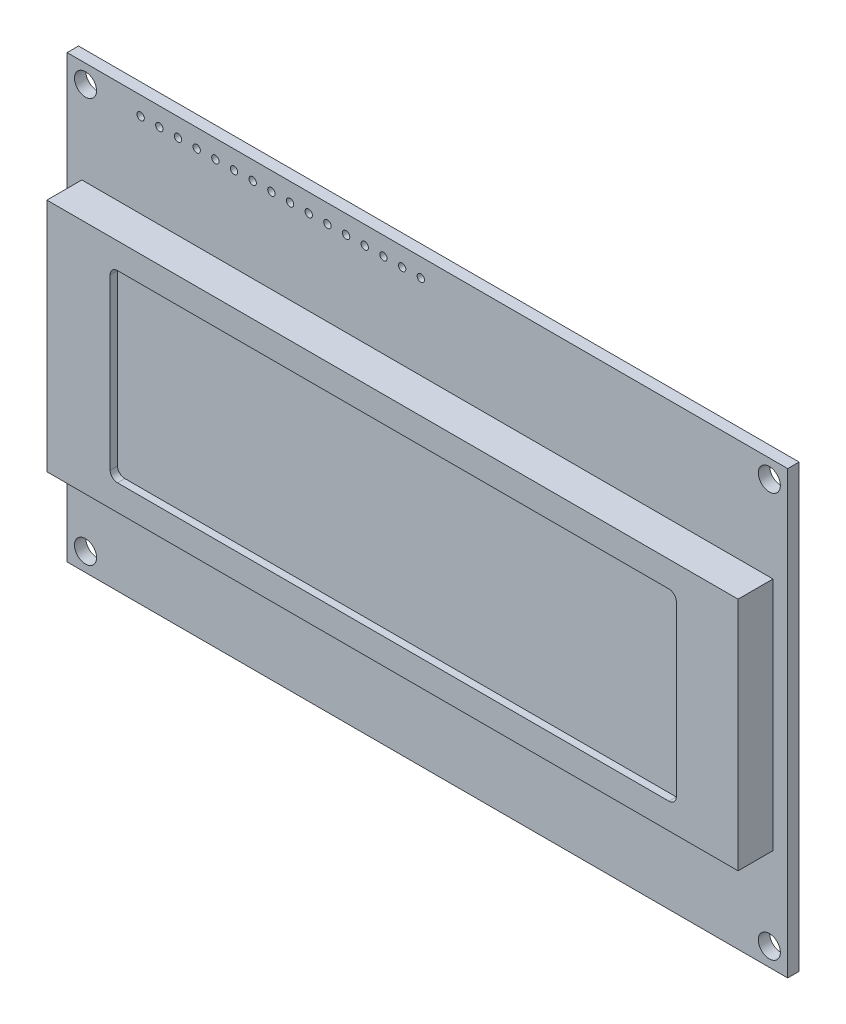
from build123d import *

# Parameters (mm, degrees)
ESQUISSE1_W             = 98
ESQUISSE1_H             = 60
ESQUISSE1_R             = 1.5
ESQUISSE1_R_2           = 0.5
BOSS_EXTRU_1_DEPTH      = 1.55
ESQUISSE2_W             = 94
ESQUISSE2_H             = 32
BOSS_EXTRU_2_DEPTH      = 4.75
ENL_V_MAT_EXTRU_2_DEPTH = 1


with BuildPart() as part:
    # Esquisse1 → Boss.-Extru.1 (new body)
    with BuildSketch(Plane.XY):
        with Locations((-13.900836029, 1.990498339)):
            Rectangle(ESQUISSE1_W, ESQUISSE1_H)
        with Locations(Location((-60.400836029, 29.490498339, 0), (0, 0, 180))):
            Circle(ESQUISSE1_R, mode=Mode.SUBTRACT)
        with Locations(Location((32.599163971, 29.490498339, 0), (0, 0, 180))):
            Circle(ESQUISSE1_R, mode=Mode.SUBTRACT)
        with Locations(Location((32.599163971, -25.509501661, 0), (0, 0, 180))):
            Circle(ESQUISSE1_R, mode=Mode.SUBTRACT)
        with Locations(Location((-60.400836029, -25.509501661, 0), (0, 0, 180))):
            Circle(ESQUISSE1_R, mode=Mode.SUBTRACT)
        with Locations((-52.900836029, 29.490498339)):
            Circle(ESQUISSE1_R_2, mode=Mode.SUBTRACT)
        with Locations((-50.360836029, 29.490498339)):
            Circle(ESQUISSE1_R_2, mode=Mode.SUBTRACT)
        with Locations((-47.820836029, 29.490498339)):
            Circle(ESQUISSE1_R_2, mode=Mode.SUBTRACT)
        with Locations((-45.280836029, 29.490498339)):
            Circle(ESQUISSE1_R_2, mode=Mode.SUBTRACT)
        with Locations((-42.740836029, 29.490498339)):
            Circle(ESQUISSE1_R_2, mode=Mode.SUBTRACT)
        with Locations((-40.200836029, 29.490498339)):
            Circle(ESQUISSE1_R_2, mode=Mode.SUBTRACT)
        with Locations((-37.660836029, 29.490498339)):
            Circle(ESQUISSE1_R_2, mode=Mode.SUBTRACT)
        with Locations((-35.120836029, 29.490498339)):
            Circle(ESQUISSE1_R_2, mode=Mode.SUBTRACT)
        with Locations((-32.580836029, 29.490498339)):
            Circle(ESQUISSE1_R_2, mode=Mode.SUBTRACT)
        with Locations((-30.040836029, 29.490498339)):
            Circle(ESQUISSE1_R_2, mode=Mode.SUBTRACT)
        with Locations((-27.500836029, 29.490498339)):
            Circle(ESQUISSE1_R_2, mode=Mode.SUBTRACT)
        with Locations((-24.960836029, 29.490498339)):
            Circle(ESQUISSE1_R_2, mode=Mode.SUBTRACT)
        with Locations((-22.420836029, 29.490498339)):
            Circle(ESQUISSE1_R_2, mode=Mode.SUBTRACT)
        with Locations((-19.880836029, 29.490498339)):
            Circle(ESQUISSE1_R_2, mode=Mode.SUBTRACT)
        with Locations((-17.340836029, 29.490498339)):
            Circle(ESQUISSE1_R_2, mode=Mode.SUBTRACT)
        with Locations((-14.800836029, 29.490498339)):
            Circle(ESQUISSE1_R_2, mode=Mode.SUBTRACT)
    extrude(amount=BOSS_EXTRU_1_DEPTH)

    # Esquisse2 → Boss.-Extru.2 (add)
    with BuildSketch(Plane.XY.offset(1.55)):
        with Locations((-13.900836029, 1.990498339)):
            Rectangle(ESQUISSE2_W, ESQUISSE2_H)
    extrude(amount=BOSS_EXTRU_2_DEPTH)

    # Esquisse5 → Enl_v. mat.-Extru.2 (cut)
    with BuildSketch(Plane.XY.offset(6.3)):
        with BuildLine():
            Line((-51.300836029, 14.490498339), (23.699163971, 14.490498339))
            ThreePointArc((23.699163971, 14.490498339), (24.406270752, 14.19760512), (24.699163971, 13.490498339))
            Line((24.699163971, 13.490498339), (24.699163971, -9.509501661))
            ThreePointArc((24.699163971, -9.509501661), (24.406270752, -10.216608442), (23.699163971, -10.509501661))
            Line((23.699163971, -10.509501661), (-51.300836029, -10.509501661))
            ThreePointArc((-51.300836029, -10.509501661), (-52.00794281, -10.216608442), (-52.300836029, -9.509501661))
            Line((-52.300836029, -9.509501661), (-52.300836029, 13.490498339))
            ThreePointArc((-52.300836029, 13.490498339), (-52.00794281, 14.19760512), (-51.300836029, 14.490498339))
        make_face()
    extrude(amount=-ENL_V_MAT_EXTRU_2_DEPTH, mode=Mode.SUBTRACT)


solid = part.part
